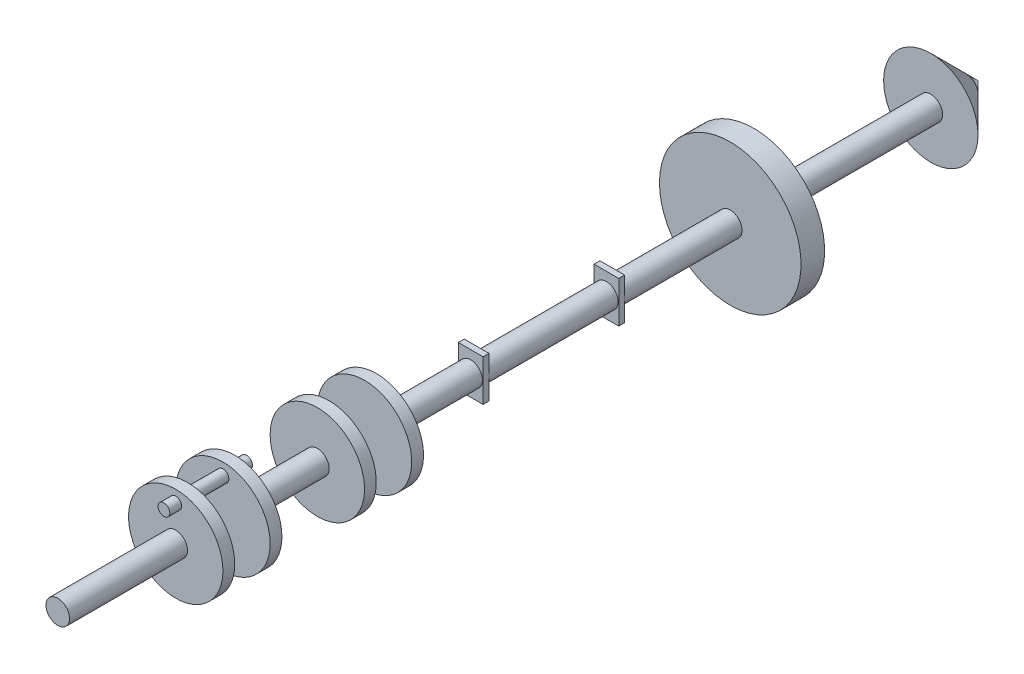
from build123d import *

# Parameters (mm, degrees)
ESQUISSE1_R                  = 10
EXTRUSION1_DEPTH             = 200
ESQUISSE2_W                  = 21
ESQUISSE2_H                  = 35
EXTRUSION2_DEPTH             = 5
EXTRUSION3_START             = 110
ESQUISSE3_R                  = 10
EXTRUSION3_DEPTH             = 110
ESQUISSE4_W                  = 21
ESQUISSE4_H                  = 35
EXTRUSION4_DEPTH             = 5
EXTRUSION5_START             = 100
ESQUISSE5_R                  = 10
EXTRUSION5_DEPTH             = 100
ESQUISSE6_R                  = 60
EXTRUSION6_DEPTH             = 20
ESQUISSE7_R                  = 40
EXTRUSION7_DEPTH             = 10
ESQUISSE8_R                  = 5
EXTRUSION8_DEPTH             = 10
EXTRUSION9_START             = 30
ESQUISSE9_R                  = 5
EXTRUSION9_DEPTH             = 30
ESQUISSE10_R                 = 40
EXTRUSION10_DEPTH            = 10
EXTRUSION11_START            = 10
ESQUISSE11_R                 = 5
EXTRUSION11_DEPTH            = 10
ESQUISSE12_R                 = 10
EXTRUSION12_DEPTH            = 100
EXTRUSION13_START            = 150
ESQUISSE13_R                 = 10
EXTRUSION13_DEPTH            = 150
ESQUISSE15_W                 = 10
ESQUISSE15_H                 = 40
ENL_V_MAT_EXTRU_1_DEPTH      = 439.292140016
ENL_V_MAT_EXTRU_1_DEPTH_BACK = 439.292140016
ESQUISSE16_W                 = 30
ESQUISSE16_H                 = 39.226562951


with BuildPart() as part:
    # Esquisse1 → Extrusion1 (new body)
    with BuildSketch(Plane.XY):
        Circle(ESQUISSE1_R)
    extrude(amount=EXTRUSION1_DEPTH)

    # Esquisse2 → Extrusion2 (add)
    with BuildSketch(Plane(origin=(0, 0, 0), x_dir=(-1, 0, 0), z_dir=(0, 0, -1))):
        Rectangle(ESQUISSE2_W, ESQUISSE2_H)
    extrude(amount=EXTRUSION2_DEPTH)

    # Esquisse3 → Extrusion3 (add)
    with BuildSketch(Plane(origin=(0, 0, -5), x_dir=(-1, 0, 0), z_dir=(0, 0, -1)).offset(EXTRUSION3_START)):
        Circle(ESQUISSE3_R)
    extrude(amount=-EXTRUSION3_DEPTH)

    # Esquisse4 → Extrusion4 (add)
    with BuildSketch(Plane(origin=(0, 0, -115), x_dir=(-1, 0, 0), z_dir=(0, 0, -1))):
        Rectangle(ESQUISSE4_W, ESQUISSE4_H)
    extrude(amount=EXTRUSION4_DEPTH)

    # Esquisse5 → Extrusion5 (add)
    with BuildSketch(Plane(origin=(0, 0, -120), x_dir=(-1, 0, 0), z_dir=(0, 0, -1)).offset(EXTRUSION5_START)):
        Circle(ESQUISSE5_R)
    extrude(amount=-EXTRUSION5_DEPTH)

    # Esquisse6 → Extrusion6 (add)
    with BuildSketch(Plane(origin=(0, 0, -220), x_dir=(-1, 0, 0), z_dir=(0, 0, -1))):
        Circle(ESQUISSE6_R)
    extrude(amount=EXTRUSION6_DEPTH)

    # Esquisse7 → Extrusion7 (add)
    with BuildSketch(Plane.XY.offset(200)):
        Circle(ESQUISSE7_R)
    extrude(amount=EXTRUSION7_DEPTH)

    # Esquisse8 → Extrusion8 (add)
    with BuildSketch(Plane(origin=(0, 0, 200), x_dir=(-1, 0, 0), z_dir=(0, 0, -1))):
        with Locations(Location((0, 30, 0), (0, 0, 180))):
            Circle(ESQUISSE8_R)
    extrude(amount=EXTRUSION8_DEPTH)

    # Esquisse9 → Extrusion9 (add)
    with BuildSketch(Plane.XY.offset(210).offset(EXTRUSION9_START)):
        with Locations((0, 30)):
            Circle(ESQUISSE9_R)
    extrude(amount=-EXTRUSION9_DEPTH)

    # Esquisse10 → Extrusion10 (add)
    with BuildSketch(Plane.XY.offset(240)):
        Circle(ESQUISSE10_R)
    extrude(amount=EXTRUSION10_DEPTH)

    # Esquisse11 → Extrusion11 (add)
    with BuildSketch(Plane.XY.offset(250).offset(EXTRUSION11_START)):
        with Locations((0, 30)):
            Circle(ESQUISSE11_R)
    extrude(amount=-EXTRUSION11_DEPTH)

    # Esquisse12 → Extrusion12 (add)
    with BuildSketch(Plane.XY.offset(250)):
        with Locations(Location((0, 0, 0), (0, 0, 180))):
            Circle(ESQUISSE12_R)
    extrude(amount=EXTRUSION12_DEPTH)

    # Esquisse13 → Extrusion13 (add)
    with BuildSketch(Plane(origin=(0, 0, -240), x_dir=(-1, 0, 0), z_dir=(0, 0, -1)).offset(EXTRUSION13_START)):
        Circle(ESQUISSE13_R)
    extrude(amount=-EXTRUSION13_DEPTH)

    # Esquisse14 → R_volution1 (revolve)
    with BuildSketch(Plane(origin=(0, 0, 0), x_dir=(0, 0, -1), z_dir=(1, 0, 0)), mode=Mode.PRIVATE) as r_volution1_sk:
        Polygon((390, 0), (390, 40), (430, 0), align=None)
    revolve(r_volution1_sk.sketch.rotate(Axis((0, 0, -430), (0, 0, 1)), 180), axis=Axis((0, 0, -430), (0, 0, 1)))

    # Esquisse15 → R_volution2 (revolve)
    with BuildSketch(Plane(origin=(0, 0, 0), x_dir=(0, 0, -1), z_dir=(1, 0, 0)), mode=Mode.PRIVATE) as r_volution2_sk:
        with Locations((-125, 20)):
            Rectangle(ESQUISSE15_W, ESQUISSE15_H)
        with Locations((-85, 20)):
            Rectangle(ESQUISSE15_W, ESQUISSE15_H)
    revolve(r_volution2_sk.sketch.rotate(Axis((0, 0, 0), (0, 0, 1)), 90), axis=Axis((0, 0, 0), (0, 0, 1)))

    # Esquisse16 → Enl_v. mat.-Extru.1 (cut, two sides: drawn at the far end of the back side and taken through both)
    with BuildSketch(Plane(origin=(0, 0, 0), x_dir=(0, 0, -1), z_dir=(1, 0, 0)).offset(-ENL_V_MAT_EXTRU_1_DEPTH_BACK)):
        with Locations((-105, -2.257622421)):
            Rectangle(ESQUISSE16_W, ESQUISSE16_H)
    extrude(amount=ENL_V_MAT_EXTRU_1_DEPTH + ENL_V_MAT_EXTRU_1_DEPTH_BACK, mode=Mode.SUBTRACT)


with BuildPart() as enl_v_mat_extru_1_piece_1:
    # of the separate pieces the step leaves, piece 1, a body of its own (enl_v_mat_extru_1_pieces)
    add(part.part.solids().sort_by_distance((0, -40, -390))[0])


with BuildPart() as enl_v_mat_extru_1_piece_2:
    # of the separate pieces the step leaves, piece 2, a body of its own (enl_v_mat_extru_1_pieces)
    add(part.part.solids().sort_by_distance((-40, 0, 120))[0])


solid = Compound([enl_v_mat_extru_1_piece_1.part, enl_v_mat_extru_1_piece_2.part])
